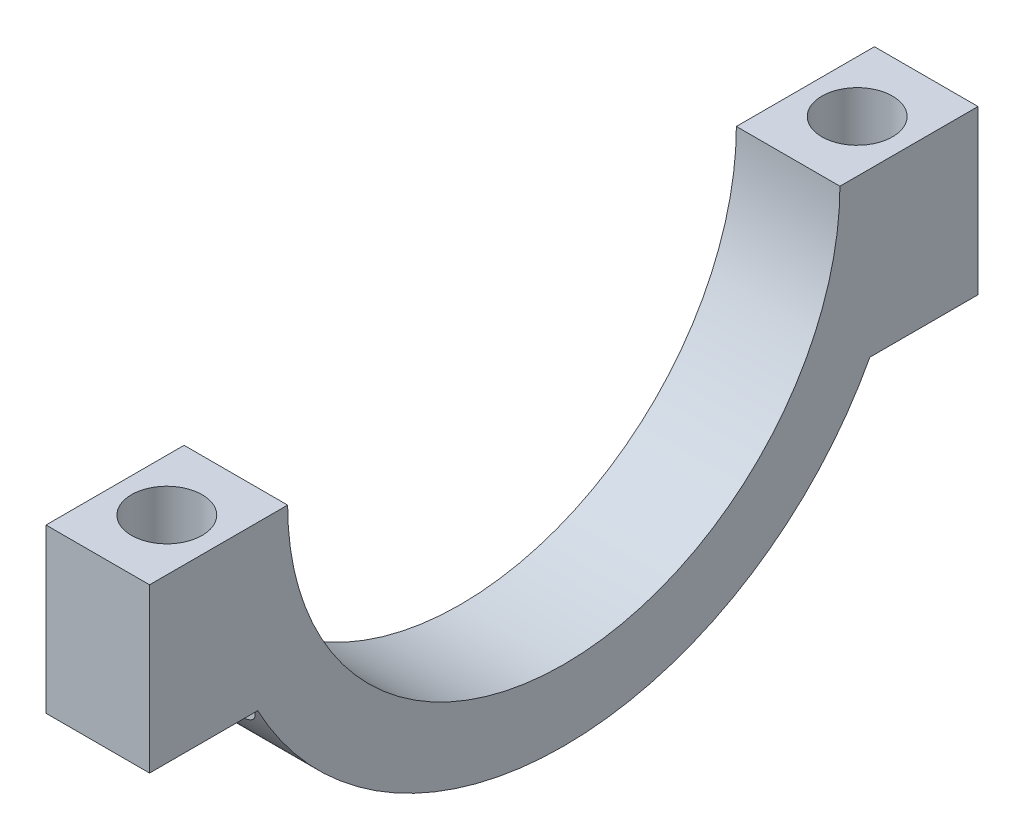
ISO-10303-21;
HEADER;
FILE_DESCRIPTION(('STEP AP214'),'2;1');
FILE_NAME('part.step','',(''),(''),'','','');
FILE_SCHEMA(('AUTOMOTIVE_DESIGN { 1 0 10303 214 1 1 1 1 }'));
ENDSEC;
DATA;
#1=APPLICATION_CONTEXT('core data for automotive mechanical design processes');
#2=APPLICATION_PROTOCOL_DEFINITION('international standard','automotive_design',2000,#1);
#3=PRODUCT_CONTEXT('',#1,'mechanical');
#4=PRODUCT('Part','Part','',(#3));
#5=PRODUCT_RELATED_PRODUCT_CATEGORY('part','',(#4));
#6=PRODUCT_DEFINITION_FORMATION('','',#4);
#7=PRODUCT_DEFINITION_CONTEXT('part definition',#1,'design');
#8=PRODUCT_DEFINITION('design','',#6,#7);
#9=PRODUCT_DEFINITION_SHAPE('','',#8);
#10=(LENGTH_UNIT() NAMED_UNIT(*) SI_UNIT(.MILLI.,.METRE.));
#11=(NAMED_UNIT(*) PLANE_ANGLE_UNIT() SI_UNIT($,.RADIAN.));
#12=(NAMED_UNIT(*) SI_UNIT($,.STERADIAN.) SOLID_ANGLE_UNIT());
#13=UNCERTAINTY_MEASURE_WITH_UNIT(LENGTH_MEASURE(1.E-05),#10,'distance_accuracy_value','');
#14=(GEOMETRIC_REPRESENTATION_CONTEXT(3) GLOBAL_UNCERTAINTY_ASSIGNED_CONTEXT((#13)) GLOBAL_UNIT_ASSIGNED_CONTEXT((#10,
#11,#12)) REPRESENTATION_CONTEXT('',''));
#15=CARTESIAN_POINT('',(0.,0.,0.));
#16=DIRECTION('',(0.,0.,1.));
#17=DIRECTION('',(1.,0.,0.));
#18=AXIS2_PLACEMENT_3D('',#15,#16,#17);
#19=CARTESIAN_POINT('',(9.525,0.,0.));
#20=DIRECTION('',(-1.,0.,0.));
#21=DIRECTION('',(0.,0.,1.));
#22=AXIS2_PLACEMENT_3D('',#19,#20,#21);
#23=CYLINDRICAL_SURFACE('',#22,63.8);
#24=CARTESIAN_POINT('',(-8.97250604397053,-30.,56.3066603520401));
#25=CARTESIAN_POINT('',(-8.88740480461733,-30.1992109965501,56.2005252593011));
#26=CARTESIAN_POINT('',(-8.79886145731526,-30.3967286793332,56.0939273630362));
#27=CARTESIAN_POINT('',(-8.61436994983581,-30.7880211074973,55.8801160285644));
#28=CARTESIAN_POINT('',(-8.51841958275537,-30.9817947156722,55.7729024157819));
#29=CARTESIAN_POINT('',(-8.31817048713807,-31.366031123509,55.5577250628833));
#30=CARTESIAN_POINT('',(-8.21383435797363,-31.5564738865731,55.4497601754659));
#31=CARTESIAN_POINT('',(-7.99670491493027,-31.9325538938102,55.2340387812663));
#32=CARTESIAN_POINT('',(-7.8839123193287,-32.1181915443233,55.1262822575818));
#33=CARTESIAN_POINT('',(-7.52830637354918,-32.6728817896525,54.8006220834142));
#34=CARTESIAN_POINT('',(-7.27136244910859,-33.0336577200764,54.5837268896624));
#35=CARTESIAN_POINT('',(-6.71616701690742,-33.7263933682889,54.1584249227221));
#36=CARTESIAN_POINT('',(-6.41800538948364,-34.0584132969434,53.9500009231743));
#37=CARTESIAN_POINT('',(-5.93761880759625,-34.5281504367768,53.6496169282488));
#38=CARTESIAN_POINT('',(-5.77243674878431,-34.6796574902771,53.551768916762));
#39=CARTESIAN_POINT('',(-5.43044514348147,-34.9724229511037,53.3610352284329));
#40=CARTESIAN_POINT('',(-5.2536352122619,-35.1136810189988,53.268149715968));
#41=CARTESIAN_POINT('',(-4.8888385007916,-35.3840632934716,53.0889283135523));
#42=CARTESIAN_POINT('',(-4.70089035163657,-35.5132258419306,53.0025719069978));
#43=CARTESIAN_POINT('',(-4.31340519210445,-35.7583587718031,52.8375019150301));
#44=CARTESIAN_POINT('',(-4.1138706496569,-35.8743319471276,52.7587867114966));
#45=CARTESIAN_POINT('',(-3.70070650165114,-36.0929581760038,52.6094682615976));
#46=CARTESIAN_POINT('',(-3.48691851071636,-36.1954016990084,52.5389942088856));
#47=CARTESIAN_POINT('',(-3.04882494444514,-36.3831465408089,52.4091564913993));
#48=CARTESIAN_POINT('',(-2.82452619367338,-36.4684587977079,52.349785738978));
#49=CARTESIAN_POINT('',(-2.36677777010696,-36.6202246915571,52.2437338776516));
#50=CARTESIAN_POINT('',(-2.13333121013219,-36.6866846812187,52.1970484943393));
#51=CARTESIAN_POINT('',(-1.65922997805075,-36.7991924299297,52.1177916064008));
#52=CARTESIAN_POINT('',(-1.41857686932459,-36.8452445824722,52.085217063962));
#53=CARTESIAN_POINT('',(-0.965981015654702,-36.9109019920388,52.0387037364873));
#54=CARTESIAN_POINT('',(-0.754635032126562,-36.9332710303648,52.022819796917));
#55=CARTESIAN_POINT('',(-0.330292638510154,-36.9614783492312,52.0027828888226));
#56=CARTESIAN_POINT('',(-0.117296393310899,-36.9673182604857,51.9986287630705));
#57=CARTESIAN_POINT('',(0.308335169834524,-36.9623440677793,52.0021646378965));
#58=CARTESIAN_POINT('',(0.520970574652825,-36.9515348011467,52.0098511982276));
#59=CARTESIAN_POINT('',(0.94401263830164,-36.9135009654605,52.0368522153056));
#60=CARTESIAN_POINT('',(1.15441938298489,-36.8862770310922,52.0561662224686));
#61=CARTESIAN_POINT('',(1.54745783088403,-36.8199862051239,52.1030714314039));
#62=CARTESIAN_POINT('',(1.73052396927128,-36.7826209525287,52.1294696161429));
#63=CARTESIAN_POINT('',(2.09248645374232,-36.6959996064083,52.1904820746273));
#64=CARTESIAN_POINT('',(2.27138130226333,-36.6467393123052,52.2250992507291));
#65=CARTESIAN_POINT('',(2.62397766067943,-36.5370363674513,52.3019067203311));
#66=CARTESIAN_POINT('',(2.79768041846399,-36.4765964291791,52.3440951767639));
#67=CARTESIAN_POINT('',(3.13925091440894,-36.345288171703,52.4353547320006));
#68=CARTESIAN_POINT('',(3.30711737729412,-36.2744175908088,52.4844273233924));
#69=CARTESIAN_POINT('',(3.69961584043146,-36.094021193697,52.608723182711));
#70=CARTESIAN_POINT('',(3.92134828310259,-35.9800899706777,52.6867611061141));
#71=CARTESIAN_POINT('',(4.35172665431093,-35.735944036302,52.8526650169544));
#72=CARTESIAN_POINT('',(4.56036835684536,-35.6057241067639,52.9405341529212));
#73=CARTESIAN_POINT('',(5.1668123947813,-35.1931573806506,53.2164486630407));
#74=CARTESIAN_POINT('',(5.54461614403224,-34.8891495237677,53.4166296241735));
#75=CARTESIAN_POINT('',(6.15751289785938,-34.321376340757,53.7825889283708));
#76=CARTESIAN_POINT('',(6.40441129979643,-34.067161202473,53.9440972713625));
#77=CARTESIAN_POINT('',(6.87125906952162,-33.5389364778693,54.2740876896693));
#78=CARTESIAN_POINT('',(7.09119261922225,-33.2649154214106,54.442573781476));
#79=CARTESIAN_POINT('',(7.50623139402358,-32.7005434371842,54.7834223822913));
#80=CARTESIAN_POINT('',(7.7013084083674,-32.4101744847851,54.9557890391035));
#81=CARTESIAN_POINT('',(8.06860008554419,-31.8162608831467,55.3017503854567));
#82=CARTESIAN_POINT('',(8.2408229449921,-31.5127210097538,55.475344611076));
#83=CARTESIAN_POINT('',(8.50587374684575,-31.0068344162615,55.7590101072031));
#84=CARTESIAN_POINT('',(8.60482732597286,-30.8077545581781,55.8692643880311));
#85=CARTESIAN_POINT('',(8.7945372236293,-30.4063683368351,56.0887239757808));
#86=CARTESIAN_POINT('',(8.88532478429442,-30.204078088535,56.1979317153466));
#87=CARTESIAN_POINT('',(8.97250604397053,-30.,56.3066603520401));
#88=B_SPLINE_CURVE_WITH_KNOTS('',3,(#24,#25,#26,#27,#28,#29,#30,#31,#32,#33,#34,#35,#36,#37,#38,
#39,#40,#41,#42,#43,#44,#45,#46,#47,#48,#49,#50,#51,#52,#53,#54,#55,#56,#57,#58,#59,#60,#61,#62,
#63,#64,#65,#66,#67,#68,#69,#70,#71,#72,#73,#74,#75,#76,#77,#78,#79,#80,#81,#82,#83,#84,#85,#86,
#87),.UNSPECIFIED.,.F.,.F.,(4,2,2,2,2,2,2,2,2,2,2,2,2,2,2,2,2,2,2,2,2,2,2,2,2,2,2,2,2,2,2,4),
(0.,0.723686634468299,1.44758972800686,2.17492267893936,2.90219392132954,4.37947105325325,
5.85357617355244,6.58683596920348,7.32012003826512,8.05099484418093,8.78171453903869,
9.52267833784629,10.2631675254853,11.0034068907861,11.743486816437,12.3819127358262,
13.0202756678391,13.6584531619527,14.2966059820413,14.8620893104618,15.427772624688,
15.9933188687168,16.5589879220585,17.3414388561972,18.124141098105,19.6913175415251,
20.8582650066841,22.025893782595,23.1948361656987,24.363358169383,25.1076789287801,
25.8490187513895),.UNSPECIFIED.);
#89=CARTESIAN_POINT('',(-8.97250604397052,-30.,56.3066603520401));
#90=VERTEX_POINT('',#89);
#91=CARTESIAN_POINT('',(8.97250604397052,-30.,56.3066603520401));
#92=VERTEX_POINT('',#91);
#93=EDGE_CURVE('E116',#90,#92,#88,.T.);
#94=ORIENTED_EDGE('',*,*,#93,.F.);
#95=DIRECTION('',(-1.,0.,0.));
#96=VECTOR('',#95,1.);
#97=CARTESIAN_POINT('',(9.525,-30.,56.3066603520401));
#98=LINE('',#97,#96);
#99=CARTESIAN_POINT('',(-9.525,-30.,56.3066603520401));
#100=VERTEX_POINT('',#99);
#101=EDGE_CURVE('E123',#90,#100,#98,.T.);
#102=ORIENTED_EDGE('',*,*,#101,.T.);
#103=CARTESIAN_POINT('',(-9.525,0.,0.));
#104=DIRECTION('',(1.,0.,0.));
#105=DIRECTION('',(0.,0.,-1.));
#106=AXIS2_PLACEMENT_3D('',#103,#104,#105);
#107=CIRCLE('',#106,63.8);
#108=CARTESIAN_POINT('',(-9.525,-30.,-56.30666035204));
#109=VERTEX_POINT('',#108);
#110=EDGE_CURVE('E157',#100,#109,#107,.T.);
#111=ORIENTED_EDGE('',*,*,#110,.T.);
#112=DIRECTION('',(-1.,0.,0.));
#113=VECTOR('',#112,1.);
#114=CARTESIAN_POINT('',(9.525,-30.,-56.30666035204));
#115=LINE('',#114,#113);
#116=CARTESIAN_POINT('',(-8.97250604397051,-30.,-56.30666035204));
#117=VERTEX_POINT('',#116);
#118=EDGE_CURVE('E137',#117,#109,#115,.T.);
#119=ORIENTED_EDGE('',*,*,#118,.F.);
#120=CARTESIAN_POINT('',(8.97250604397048,-30.,-56.30666035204));
#121=CARTESIAN_POINT('',(8.88740480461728,-30.1992109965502,-56.2005252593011));
#122=CARTESIAN_POINT('',(8.79886145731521,-30.3967286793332,-56.0939273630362));
#123=CARTESIAN_POINT('',(8.61436994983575,-30.7880211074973,-55.8801160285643));
#124=CARTESIAN_POINT('',(8.51841958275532,-30.9817947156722,-55.7729024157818));
#125=CARTESIAN_POINT('',(8.31817048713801,-31.366031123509,-55.5577250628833));
#126=CARTESIAN_POINT('',(8.21383435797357,-31.5564738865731,-55.4497601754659));
#127=CARTESIAN_POINT('',(7.99670491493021,-31.9325538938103,-55.2340387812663));
#128=CARTESIAN_POINT('',(7.88391231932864,-32.1181915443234,-55.1262822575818));
#129=CARTESIAN_POINT('',(7.52830637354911,-32.6728817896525,-54.8006220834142));
#130=CARTESIAN_POINT('',(7.27136244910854,-33.0336577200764,-54.5837268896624));
#131=CARTESIAN_POINT('',(6.71616701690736,-33.7263933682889,-54.1584249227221));
#132=CARTESIAN_POINT('',(6.41800538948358,-34.0584132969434,-53.9500009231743));
#133=CARTESIAN_POINT('',(5.93761880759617,-34.5281504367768,-53.6496169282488));
#134=CARTESIAN_POINT('',(5.77243674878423,-34.6796574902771,-53.551768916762));
#135=CARTESIAN_POINT('',(5.43044514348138,-34.9724229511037,-53.3610352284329));
#136=CARTESIAN_POINT('',(5.25363521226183,-35.1136810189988,-53.268149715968));
#137=CARTESIAN_POINT('',(4.88883850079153,-35.3840632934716,-53.0889283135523));
#138=CARTESIAN_POINT('',(4.70089035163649,-35.5132258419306,-53.0025719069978));
#139=CARTESIAN_POINT('',(4.31340519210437,-35.7583587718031,-52.8375019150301));
#140=CARTESIAN_POINT('',(4.11387064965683,-35.8743319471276,-52.7587867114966));
#141=CARTESIAN_POINT('',(3.70070650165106,-36.0929581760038,-52.6094682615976));
#142=CARTESIAN_POINT('',(3.48691851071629,-36.1954016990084,-52.5389942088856));
#143=CARTESIAN_POINT('',(3.04882494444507,-36.3831465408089,-52.4091564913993));
#144=CARTESIAN_POINT('',(2.8245261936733,-36.4684587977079,-52.349785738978));
#145=CARTESIAN_POINT('',(2.36677777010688,-36.6202246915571,-52.2437338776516));
#146=CARTESIAN_POINT('',(2.13333121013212,-36.6866846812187,-52.1970484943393));
#147=CARTESIAN_POINT('',(1.65922997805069,-36.7991924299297,-52.1177916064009));
#148=CARTESIAN_POINT('',(1.41857686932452,-36.8452445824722,-52.085217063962));
#149=CARTESIAN_POINT('',(0.965981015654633,-36.9109019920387,-52.0387037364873));
#150=CARTESIAN_POINT('',(0.754635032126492,-36.9332710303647,-52.022819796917));
#151=CARTESIAN_POINT('',(0.330292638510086,-36.9614783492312,-52.0027828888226));
#152=CARTESIAN_POINT('',(0.117296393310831,-36.9673182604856,-51.9986287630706));
#153=CARTESIAN_POINT('',(-0.308335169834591,-36.9623440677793,-52.0021646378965));
#154=CARTESIAN_POINT('',(-0.520970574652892,-36.9515348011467,-52.0098511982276));
#155=CARTESIAN_POINT('',(-0.944012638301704,-36.9135009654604,-52.0368522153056));
#156=CARTESIAN_POINT('',(-1.15441938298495,-36.8862770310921,-52.0561662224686));
#157=CARTESIAN_POINT('',(-1.54745783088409,-36.8199862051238,-52.1030714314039));
#158=CARTESIAN_POINT('',(-1.73052396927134,-36.7826209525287,-52.129469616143));
#159=CARTESIAN_POINT('',(-2.09248645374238,-36.6959996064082,-52.1904820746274));
#160=CARTESIAN_POINT('',(-2.27138130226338,-36.6467393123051,-52.2250992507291));
#161=CARTESIAN_POINT('',(-2.62397766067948,-36.5370363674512,-52.3019067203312));
#162=CARTESIAN_POINT('',(-2.79768041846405,-36.4765964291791,-52.344095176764));
#163=CARTESIAN_POINT('',(-3.139250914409,-36.345288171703,-52.4353547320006));
#164=CARTESIAN_POINT('',(-3.30711737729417,-36.2744175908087,-52.4844273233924));
#165=CARTESIAN_POINT('',(-3.69961584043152,-36.094021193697,-52.608723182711));
#166=CARTESIAN_POINT('',(-3.92134828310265,-35.9800899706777,-52.6867611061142));
#167=CARTESIAN_POINT('',(-4.35172665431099,-35.735944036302,-52.8526650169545));
#168=CARTESIAN_POINT('',(-4.56036835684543,-35.6057241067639,-52.9405341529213));
#169=CARTESIAN_POINT('',(-5.16681239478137,-35.1931573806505,-53.2164486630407));
#170=CARTESIAN_POINT('',(-5.5446161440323,-34.8891495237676,-53.4166296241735));
#171=CARTESIAN_POINT('',(-6.15751289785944,-34.3213763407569,-53.7825889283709));
#172=CARTESIAN_POINT('',(-6.40441129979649,-34.067161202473,-53.9440972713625));
#173=CARTESIAN_POINT('',(-6.87125906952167,-33.5389364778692,-54.2740876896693));
#174=CARTESIAN_POINT('',(-7.09119261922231,-33.2649154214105,-54.442573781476));
#175=CARTESIAN_POINT('',(-7.50623139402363,-32.7005434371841,-54.7834223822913));
#176=CARTESIAN_POINT('',(-7.70130840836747,-32.410174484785,-54.9557890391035));
#177=CARTESIAN_POINT('',(-8.06860008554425,-31.8162608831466,-55.3017503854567));
#178=CARTESIAN_POINT('',(-8.24082294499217,-31.5127210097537,-55.4753446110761));
#179=CARTESIAN_POINT('',(-8.5058737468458,-31.0068344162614,-55.7590101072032));
#180=CARTESIAN_POINT('',(-8.6048273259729,-30.8077545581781,-55.8692643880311));
#181=CARTESIAN_POINT('',(-8.79453722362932,-30.406368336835,-56.0887239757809));
#182=CARTESIAN_POINT('',(-8.88532478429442,-30.204078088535,-56.1979317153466));
#183=CARTESIAN_POINT('',(-8.97250604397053,-30.,-56.3066603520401));
#184=B_SPLINE_CURVE_WITH_KNOTS('',3,(#120,#121,#122,#123,#124,#125,#126,#127,#128,#129,#130,
#131,#132,#133,#134,#135,#136,#137,#138,#139,#140,#141,#142,#143,#144,#145,#146,#147,#148,#149,
#150,#151,#152,#153,#154,#155,#156,#157,#158,#159,#160,#161,#162,#163,#164,#165,#166,#167,#168,
#169,#170,#171,#172,#173,#174,#175,#176,#177,#178,#179,#180,#181,#182,#183),.UNSPECIFIED.,.F.,
.F.,(4,2,2,2,2,2,2,2,2,2,2,2,2,2,2,2,2,2,2,2,2,2,2,2,2,2,2,2,2,2,2,4),(0.,0.723686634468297,
1.44758972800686,2.17492267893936,2.90219392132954,4.37947105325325,5.85357617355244,
6.58683596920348,7.32012003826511,8.05099484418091,8.78171453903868,9.52267833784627,
10.2631675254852,11.0034068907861,11.743486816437,12.3819127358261,13.0202756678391,
13.6584531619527,14.2966059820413,14.8620893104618,15.4277726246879,15.9933188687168,
16.5589879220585,17.3414388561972,18.1241410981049,19.6913175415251,20.8582650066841,
22.025893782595,23.1948361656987,24.363358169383,25.1076789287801,25.8490187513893),.UNSPECIFIED.);
#185=CARTESIAN_POINT('',(8.97250604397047,-30.,-56.30666035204));
#186=VERTEX_POINT('',#185);
#187=EDGE_CURVE('E118',#186,#117,#184,.T.);
#188=ORIENTED_EDGE('',*,*,#187,.F.);
#189=CARTESIAN_POINT('',(9.525,-30.,-56.30666035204));
#190=VERTEX_POINT('',#189);
#191=EDGE_CURVE('E134',#190,#186,#115,.T.);
#192=ORIENTED_EDGE('',*,*,#191,.F.);
#193=CARTESIAN_POINT('',(9.525,0.,0.));
#194=DIRECTION('',(1.,0.,0.));
#195=DIRECTION('',(0.,0.,-1.));
#196=AXIS2_PLACEMENT_3D('',#193,#194,#195);
#197=CIRCLE('',#196,63.8);
#198=CARTESIAN_POINT('',(9.525,-30.,56.3066603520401));
#199=VERTEX_POINT('',#198);
#200=EDGE_CURVE('E223',#199,#190,#197,.T.);
#201=ORIENTED_EDGE('',*,*,#200,.F.);
#202=EDGE_CURVE('E126',#199,#92,#98,.T.);
#203=ORIENTED_EDGE('',*,*,#202,.T.);
#204=EDGE_LOOP('',(#94,#102,#111,#119,#188,#192,#201,#203));
#205=FACE_BOUND('',#204,.T.);
#206=ADVANCED_FACE('F37',(#205),#23,.T.);
#207=CARTESIAN_POINT('',(9.525,0.,0.));
#208=DIRECTION('',(-1.,0.,0.));
#209=DIRECTION('',(0.,0.,1.));
#210=AXIS2_PLACEMENT_3D('',#207,#208,#209);
#211=CYLINDRICAL_SURFACE('',#210,50.8);
#212=CARTESIAN_POINT('',(-9.525,0.,0.));
#213=DIRECTION('',(-1.,0.,0.));
#214=DIRECTION('',(0.,0.,1.));
#215=AXIS2_PLACEMENT_3D('',#212,#213,#214);
#216=CIRCLE('',#215,50.8);
#217=CARTESIAN_POINT('',(-9.525,0.,-50.8));
#218=VERTEX_POINT('',#217);
#219=CARTESIAN_POINT('',(-9.525,0.,50.8));
#220=VERTEX_POINT('',#219);
#221=EDGE_CURVE('E159',#218,#220,#216,.T.);
#222=ORIENTED_EDGE('',*,*,#221,.T.);
#223=DIRECTION('',(-1.,0.,0.));
#224=VECTOR('',#223,1.);
#225=CARTESIAN_POINT('',(9.525,0.,50.8));
#226=LINE('',#225,#224);
#227=CARTESIAN_POINT('',(9.525,0.,50.8));
#228=VERTEX_POINT('',#227);
#229=EDGE_CURVE('E11',#228,#220,#226,.T.);
#230=ORIENTED_EDGE('',*,*,#229,.F.);
#231=CARTESIAN_POINT('',(9.525,0.,0.));
#232=DIRECTION('',(-1.,0.,0.));
#233=DIRECTION('',(0.,0.,1.));
#234=AXIS2_PLACEMENT_3D('',#231,#232,#233);
#235=CIRCLE('',#234,50.8);
#236=CARTESIAN_POINT('',(9.525,0.,-50.8));
#237=VERTEX_POINT('',#236);
#238=EDGE_CURVE('E170',#237,#228,#235,.T.);
#239=ORIENTED_EDGE('',*,*,#238,.F.);
#240=DIRECTION('',(-1.,0.,0.));
#241=VECTOR('',#240,1.);
#242=CARTESIAN_POINT('',(9.525,0.,-50.8));
#243=LINE('',#242,#241);
#244=EDGE_CURVE('E171',#237,#218,#243,.T.);
#245=ORIENTED_EDGE('',*,*,#244,.T.);
#246=EDGE_LOOP('',(#222,#230,#239,#245));
#247=FACE_BOUND('',#246,.T.);
#248=ADVANCED_FACE('F39',(#247),#211,.F.);
#249=CARTESIAN_POINT('',(9.525,0.,50.8));
#250=DIRECTION('',(0.,-1.,0.));
#251=DIRECTION('',(0.,0.,-1.));
#252=AXIS2_PLACEMENT_3D('',#249,#250,#251);
#253=PLANE('',#252);
#254=CARTESIAN_POINT('',(0.,0.,63.5));
#255=DIRECTION('',(0.,1.,0.));
#256=DIRECTION('',(0.,0.,1.));
#257=AXIS2_PLACEMENT_3D('',#254,#255,#256);
#258=CIRCLE('',#257,6.5);
#259=CARTESIAN_POINT('',(0.,0.,70.));
#260=VERTEX_POINT('',#259);
#261=EDGE_CURVE('E127',#260,#260,#258,.T.);
#262=ORIENTED_EDGE('',*,*,#261,.F.);
#263=EDGE_LOOP('',(#262));
#264=FACE_BOUND('',#263,.T.);
#265=DIRECTION('',(0.,0.,1.));
#266=VECTOR('',#265,1.);
#267=CARTESIAN_POINT('',(-9.525,0.,50.8));
#268=LINE('',#267,#266);
#269=CARTESIAN_POINT('',(-9.525,0.,76.2));
#270=VERTEX_POINT('',#269);
#271=EDGE_CURVE('E155',#220,#270,#268,.T.);
#272=ORIENTED_EDGE('',*,*,#271,.T.);
#273=DIRECTION('',(-1.,0.,0.));
#274=VECTOR('',#273,1.);
#275=CARTESIAN_POINT('',(9.525,0.,76.2));
#276=LINE('',#275,#274);
#277=CARTESIAN_POINT('',(9.525,0.,76.2));
#278=VERTEX_POINT('',#277);
#279=EDGE_CURVE('E46',#278,#270,#276,.T.);
#280=ORIENTED_EDGE('',*,*,#279,.F.);
#281=DIRECTION('',(0.,0.,1.));
#282=VECTOR('',#281,1.);
#283=CARTESIAN_POINT('',(9.525,0.,50.8));
#284=LINE('',#283,#282);
#285=EDGE_CURVE('E218',#228,#278,#284,.T.);
#286=ORIENTED_EDGE('',*,*,#285,.F.);
#287=ORIENTED_EDGE('',*,*,#229,.T.);
#288=EDGE_LOOP('',(#272,#280,#286,#287));
#289=FACE_BOUND('',#288,.T.);
#290=ADVANCED_FACE('F273',(#264,#289),#253,.F.);
#291=CARTESIAN_POINT('',(9.525,0.,76.2));
#292=DIRECTION('',(0.,0.,-1.));
#293=DIRECTION('',(-1.,0.,0.));
#294=AXIS2_PLACEMENT_3D('',#291,#292,#293);
#295=PLANE('',#294);
#296=DIRECTION('',(0.,-1.,0.));
#297=VECTOR('',#296,1.);
#298=CARTESIAN_POINT('',(-9.525,0.,76.2));
#299=LINE('',#298,#297);
#300=CARTESIAN_POINT('',(-9.525,-30.,76.2));
#301=VERTEX_POINT('',#300);
#302=EDGE_CURVE('E149',#270,#301,#299,.T.);
#303=ORIENTED_EDGE('',*,*,#302,.T.);
#304=DIRECTION('',(-1.,0.,0.));
#305=VECTOR('',#304,1.);
#306=CARTESIAN_POINT('',(9.525,-30.,76.2));
#307=LINE('',#306,#305);
#308=CARTESIAN_POINT('',(9.525,-30.,76.2));
#309=VERTEX_POINT('',#308);
#310=EDGE_CURVE('E136',#309,#301,#307,.T.);
#311=ORIENTED_EDGE('',*,*,#310,.F.);
#312=DIRECTION('',(0.,-1.,0.));
#313=VECTOR('',#312,1.);
#314=CARTESIAN_POINT('',(9.525,0.,76.2));
#315=LINE('',#314,#313);
#316=EDGE_CURVE('E150',#278,#309,#315,.T.);
#317=ORIENTED_EDGE('',*,*,#316,.F.);
#318=ORIENTED_EDGE('',*,*,#279,.T.);
#319=EDGE_LOOP('',(#303,#311,#317,#318));
#320=FACE_BOUND('',#319,.T.);
#321=ADVANCED_FACE('F147',(#320),#295,.F.);
#322=CARTESIAN_POINT('',(9.525,-30.,76.2));
#323=DIRECTION('',(0.,1.,0.));
#324=DIRECTION('',(0.,0.,1.));
#325=AXIS2_PLACEMENT_3D('',#322,#323,#324);
#326=PLANE('',#325);
#327=DIRECTION('',(0.,0.,-1.));
#328=VECTOR('',#327,1.);
#329=CARTESIAN_POINT('',(-9.525,-30.,76.2));
#330=LINE('',#329,#328);
#331=EDGE_CURVE('E133',#301,#100,#330,.T.);
#332=ORIENTED_EDGE('',*,*,#331,.T.);
#333=ORIENTED_EDGE('',*,*,#101,.F.);
#334=CARTESIAN_POINT('',(0.,-30.,63.5));
#335=DIRECTION('',(0.,-1.,0.));
#336=DIRECTION('',(0.,0.,-1.));
#337=AXIS2_PLACEMENT_3D('',#334,#335,#336);
#338=CIRCLE('',#337,11.5);
#339=EDGE_CURVE('E53',#90,#92,#338,.T.);
#340=ORIENTED_EDGE('',*,*,#339,.T.);
#341=ORIENTED_EDGE('',*,*,#202,.F.);
#342=DIRECTION('',(0.,0.,-1.));
#343=VECTOR('',#342,1.);
#344=CARTESIAN_POINT('',(9.525,-30.,76.2));
#345=LINE('',#344,#343);
#346=EDGE_CURVE('E221',#309,#199,#345,.T.);
#347=ORIENTED_EDGE('',*,*,#346,.F.);
#348=ORIENTED_EDGE('',*,*,#310,.T.);
#349=EDGE_LOOP('',(#332,#333,#340,#341,#347,#348));
#350=FACE_BOUND('',#349,.T.);
#351=CARTESIAN_POINT('',(0.,-30.,63.5));
#352=DIRECTION('',(0.,1.,0.));
#353=DIRECTION('',(0.,0.,1.));
#354=AXIS2_PLACEMENT_3D('',#351,#352,#353);
#355=CIRCLE('',#354,6.5);
#356=CARTESIAN_POINT('',(0.,-30.,70.));
#357=VERTEX_POINT('',#356);
#358=EDGE_CURVE('E41',#357,#357,#355,.T.);
#359=ORIENTED_EDGE('',*,*,#358,.T.);
#360=EDGE_LOOP('',(#359));
#361=FACE_BOUND('',#360,.T.);
#362=ADVANCED_FACE('F129',(#350,#361),#326,.F.);
#363=CARTESIAN_POINT('',(9.525,-30.,-56.3066603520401));
#364=DIRECTION('',(0.,1.,0.));
#365=DIRECTION('',(0.,0.,1.));
#366=AXIS2_PLACEMENT_3D('',#363,#364,#365);
#367=PLANE('',#366);
#368=ORIENTED_EDGE('',*,*,#191,.T.);
#369=CARTESIAN_POINT('',(0.,-30.,-63.5));
#370=DIRECTION('',(0.,-1.,0.));
#371=DIRECTION('',(0.,0.,-1.));
#372=AXIS2_PLACEMENT_3D('',#369,#370,#371);
#373=CIRCLE('',#372,11.5);
#374=EDGE_CURVE('E61',#186,#117,#373,.T.);
#375=ORIENTED_EDGE('',*,*,#374,.T.);
#376=ORIENTED_EDGE('',*,*,#118,.T.);
#377=DIRECTION('',(0.,0.,-1.));
#378=VECTOR('',#377,1.);
#379=CARTESIAN_POINT('',(-9.525,-30.,-56.3066603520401));
#380=LINE('',#379,#378);
#381=CARTESIAN_POINT('',(-9.525,-30.,-76.2));
#382=VERTEX_POINT('',#381);
#383=EDGE_CURVE('E164',#109,#382,#380,.T.);
#384=ORIENTED_EDGE('',*,*,#383,.T.);
#385=DIRECTION('',(-1.,0.,0.));
#386=VECTOR('',#385,1.);
#387=CARTESIAN_POINT('',(9.525,-30.,-76.2));
#388=LINE('',#387,#386);
#389=CARTESIAN_POINT('',(9.525,-30.,-76.2));
#390=VERTEX_POINT('',#389);
#391=EDGE_CURVE('E177',#390,#382,#388,.T.);
#392=ORIENTED_EDGE('',*,*,#391,.F.);
#393=DIRECTION('',(0.,0.,-1.));
#394=VECTOR('',#393,1.);
#395=CARTESIAN_POINT('',(9.525,-30.,-56.3066603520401));
#396=LINE('',#395,#394);
#397=EDGE_CURVE('E200',#190,#390,#396,.T.);
#398=ORIENTED_EDGE('',*,*,#397,.F.);
#399=EDGE_LOOP('',(#368,#375,#376,#384,#392,#398));
#400=FACE_BOUND('',#399,.T.);
#401=CARTESIAN_POINT('',(0.,-30.,-63.5));
#402=DIRECTION('',(0.,1.,0.));
#403=DIRECTION('',(0.,0.,1.));
#404=AXIS2_PLACEMENT_3D('',#401,#402,#403);
#405=CIRCLE('',#404,6.5);
#406=CARTESIAN_POINT('',(0.,-30.,-57.));
#407=VERTEX_POINT('',#406);
#408=EDGE_CURVE('E207',#407,#407,#405,.T.);
#409=ORIENTED_EDGE('',*,*,#408,.T.);
#410=EDGE_LOOP('',(#409));
#411=FACE_BOUND('',#410,.T.);
#412=ADVANCED_FACE('F184',(#400,#411),#367,.F.);
#413=CARTESIAN_POINT('',(9.525,0.,-76.2));
#414=DIRECTION('',(0.,0.,1.));
#415=DIRECTION('',(1.,0.,0.));
#416=AXIS2_PLACEMENT_3D('',#413,#414,#415);
#417=PLANE('',#416);
#418=DIRECTION('',(0.,1.,0.));
#419=VECTOR('',#418,1.);
#420=CARTESIAN_POINT('',(-9.525,0.,-76.2));
#421=LINE('',#420,#419);
#422=CARTESIAN_POINT('',(-9.525,0.,-76.2));
#423=VERTEX_POINT('',#422);
#424=EDGE_CURVE('E166',#382,#423,#421,.T.);
#425=ORIENTED_EDGE('',*,*,#424,.T.);
#426=DIRECTION('',(-1.,0.,0.));
#427=VECTOR('',#426,1.);
#428=CARTESIAN_POINT('',(9.525,0.,-76.2));
#429=LINE('',#428,#427);
#430=CARTESIAN_POINT('',(9.525,0.,-76.2));
#431=VERTEX_POINT('',#430);
#432=EDGE_CURVE('E174',#431,#423,#429,.T.);
#433=ORIENTED_EDGE('',*,*,#432,.F.);
#434=DIRECTION('',(0.,1.,0.));
#435=VECTOR('',#434,1.);
#436=CARTESIAN_POINT('',(9.525,0.,-76.2));
#437=LINE('',#436,#435);
#438=EDGE_CURVE('E198',#390,#431,#437,.T.);
#439=ORIENTED_EDGE('',*,*,#438,.F.);
#440=ORIENTED_EDGE('',*,*,#391,.T.);
#441=EDGE_LOOP('',(#425,#433,#439,#440));
#442=FACE_BOUND('',#441,.T.);
#443=ADVANCED_FACE('F190',(#442),#417,.F.);
#444=CARTESIAN_POINT('',(9.525,0.,-50.8));
#445=DIRECTION('',(0.,-1.,0.));
#446=DIRECTION('',(0.,0.,-1.));
#447=AXIS2_PLACEMENT_3D('',#444,#445,#446);
#448=PLANE('',#447);
#449=CARTESIAN_POINT('',(0.,0.,-63.5));
#450=DIRECTION('',(0.,1.,0.));
#451=DIRECTION('',(0.,0.,1.));
#452=AXIS2_PLACEMENT_3D('',#449,#450,#451);
#453=CIRCLE('',#452,6.5);
#454=CARTESIAN_POINT('',(0.,0.,-57.));
#455=VERTEX_POINT('',#454);
#456=EDGE_CURVE('E210',#455,#455,#453,.T.);
#457=ORIENTED_EDGE('',*,*,#456,.F.);
#458=EDGE_LOOP('',(#457));
#459=FACE_BOUND('',#458,.T.);
#460=DIRECTION('',(0.,0.,1.));
#461=VECTOR('',#460,1.);
#462=CARTESIAN_POINT('',(-9.525,0.,-50.8));
#463=LINE('',#462,#461);
#464=EDGE_CURVE('E168',#423,#218,#463,.T.);
#465=ORIENTED_EDGE('',*,*,#464,.T.);
#466=ORIENTED_EDGE('',*,*,#244,.F.);
#467=DIRECTION('',(0.,0.,1.));
#468=VECTOR('',#467,1.);
#469=CARTESIAN_POINT('',(9.525,0.,-50.8));
#470=LINE('',#469,#468);
#471=EDGE_CURVE('E175',#431,#237,#470,.T.);
#472=ORIENTED_EDGE('',*,*,#471,.F.);
#473=ORIENTED_EDGE('',*,*,#432,.T.);
#474=EDGE_LOOP('',(#465,#466,#472,#473));
#475=FACE_BOUND('',#474,.T.);
#476=ADVANCED_FACE('F193',(#459,#475),#448,.F.);
#477=CARTESIAN_POINT('',(9.525,0.,0.));
#478=DIRECTION('',(-1.,0.,0.));
#479=DIRECTION('',(0.,0.,1.));
#480=AXIS2_PLACEMENT_3D('',#477,#478,#479);
#481=PLANE('',#480);
#482=ORIENTED_EDGE('',*,*,#238,.T.);
#483=ORIENTED_EDGE('',*,*,#285,.T.);
#484=ORIENTED_EDGE('',*,*,#316,.T.);
#485=ORIENTED_EDGE('',*,*,#346,.T.);
#486=ORIENTED_EDGE('',*,*,#200,.T.);
#487=ORIENTED_EDGE('',*,*,#397,.T.);
#488=ORIENTED_EDGE('',*,*,#438,.T.);
#489=ORIENTED_EDGE('',*,*,#471,.T.);
#490=EDGE_LOOP('',(#482,#483,#484,#485,#486,#487,#488,#489));
#491=FACE_BOUND('',#490,.T.);
#492=ADVANCED_FACE('F225',(#491),#481,.F.);
#493=CARTESIAN_POINT('',(-9.525,0.,0.));
#494=DIRECTION('',(-1.,0.,0.));
#495=DIRECTION('',(0.,0.,1.));
#496=AXIS2_PLACEMENT_3D('',#493,#494,#495);
#497=PLANE('',#496);
#498=ORIENTED_EDGE('',*,*,#221,.F.);
#499=ORIENTED_EDGE('',*,*,#464,.F.);
#500=ORIENTED_EDGE('',*,*,#424,.F.);
#501=ORIENTED_EDGE('',*,*,#383,.F.);
#502=ORIENTED_EDGE('',*,*,#110,.F.);
#503=ORIENTED_EDGE('',*,*,#331,.F.);
#504=ORIENTED_EDGE('',*,*,#302,.F.);
#505=ORIENTED_EDGE('',*,*,#271,.F.);
#506=EDGE_LOOP('',(#498,#499,#500,#501,#502,#503,#504,#505));
#507=FACE_BOUND('',#506,.T.);
#508=ADVANCED_FACE('F154',(#507),#497,.T.);
#509=CARTESIAN_POINT('',(0.,-63.8,-63.5));
#510=DIRECTION('',(0.,1.,0.));
#511=DIRECTION('',(0.,0.,1.));
#512=AXIS2_PLACEMENT_3D('',#509,#510,#511);
#513=CYLINDRICAL_SURFACE('',#512,6.5);
#514=ORIENTED_EDGE('',*,*,#456,.T.);
#515=EDGE_LOOP('',(#514));
#516=FACE_BOUND('',#515,.T.);
#517=ORIENTED_EDGE('',*,*,#408,.F.);
#518=EDGE_LOOP('',(#517));
#519=FACE_BOUND('',#518,.T.);
#520=ADVANCED_FACE('F250',(#516,#519),#513,.F.);
#521=CARTESIAN_POINT('',(0.,-63.8,63.5));
#522=DIRECTION('',(0.,1.,0.));
#523=DIRECTION('',(0.,0.,1.));
#524=AXIS2_PLACEMENT_3D('',#521,#522,#523);
#525=CYLINDRICAL_SURFACE('',#524,6.5);
#526=ORIENTED_EDGE('',*,*,#261,.T.);
#527=EDGE_LOOP('',(#526));
#528=FACE_BOUND('',#527,.T.);
#529=ORIENTED_EDGE('',*,*,#358,.F.);
#530=EDGE_LOOP('',(#529));
#531=FACE_BOUND('',#530,.T.);
#532=ADVANCED_FACE('F248',(#528,#531),#525,.F.);
#533=CARTESIAN_POINT('',(0.,-49.05,-63.5));
#534=DIRECTION('',(0.,1.,0.));
#535=DIRECTION('',(0.,0.,1.));
#536=AXIS2_PLACEMENT_3D('',#533,#534,#535);
#537=CYLINDRICAL_SURFACE('',#536,11.5);
#538=ORIENTED_EDGE('',*,*,#187,.T.);
#539=ORIENTED_EDGE('',*,*,#374,.F.);
#540=EDGE_LOOP('',(#538,#539));
#541=FACE_BOUND('',#540,.T.);
#542=ADVANCED_FACE('F244',(#541),#537,.F.);
#543=CARTESIAN_POINT('',(0.,-49.05,63.5));
#544=DIRECTION('',(0.,1.,0.));
#545=DIRECTION('',(0.,0.,1.));
#546=AXIS2_PLACEMENT_3D('',#543,#544,#545);
#547=CYLINDRICAL_SURFACE('',#546,11.5);
#548=ORIENTED_EDGE('',*,*,#93,.T.);
#549=ORIENTED_EDGE('',*,*,#339,.F.);
#550=EDGE_LOOP('',(#548,#549));
#551=FACE_BOUND('',#550,.T.);
#552=ADVANCED_FACE('F115',(#551),#547,.F.);
#553=CLOSED_SHELL('',(#206,#248,#290,#321,#362,#412,#443,#476,#492,#508,#520,#532,#542,#552));
#554=MANIFOLD_SOLID_BREP('B2',#553);
#555=ADVANCED_BREP_SHAPE_REPRESENTATION('',(#18,#554),#14);
#556=SHAPE_DEFINITION_REPRESENTATION(#9,#555);
ENDSEC;
END-ISO-10303-21;
